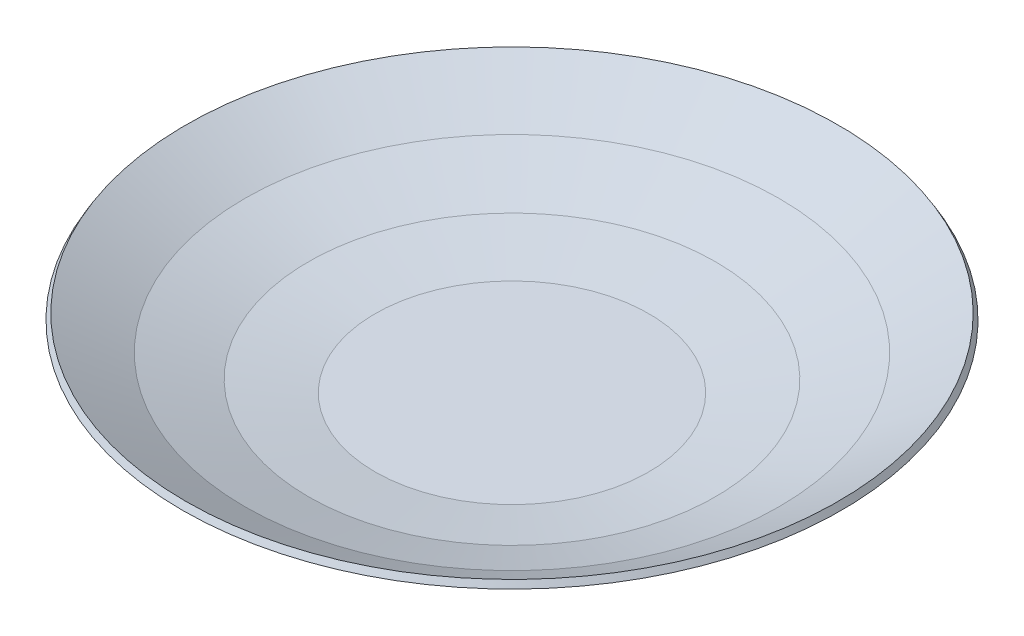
ISO-10303-21;
HEADER;
FILE_DESCRIPTION(('STEP AP214'),'2;1');
FILE_NAME('part.step','',(''),(''),'','','');
FILE_SCHEMA(('AUTOMOTIVE_DESIGN { 1 0 10303 214 1 1 1 1 }'));
ENDSEC;
DATA;
#1=APPLICATION_CONTEXT('core data for automotive mechanical design processes');
#2=APPLICATION_PROTOCOL_DEFINITION('international standard','automotive_design',2000,#1);
#3=PRODUCT_CONTEXT('',#1,'mechanical');
#4=PRODUCT('Part','Part','',(#3));
#5=PRODUCT_RELATED_PRODUCT_CATEGORY('part','',(#4));
#6=PRODUCT_DEFINITION_FORMATION('','',#4);
#7=PRODUCT_DEFINITION_CONTEXT('part definition',#1,'design');
#8=PRODUCT_DEFINITION('design','',#6,#7);
#9=PRODUCT_DEFINITION_SHAPE('','',#8);
#10=(LENGTH_UNIT() NAMED_UNIT(*) SI_UNIT(.MILLI.,.METRE.));
#11=(NAMED_UNIT(*) PLANE_ANGLE_UNIT() SI_UNIT($,.RADIAN.));
#12=(NAMED_UNIT(*) SI_UNIT($,.STERADIAN.) SOLID_ANGLE_UNIT());
#13=UNCERTAINTY_MEASURE_WITH_UNIT(LENGTH_MEASURE(1.E-05),#10,'distance_accuracy_value','');
#14=(GEOMETRIC_REPRESENTATION_CONTEXT(3) GLOBAL_UNCERTAINTY_ASSIGNED_CONTEXT((#13)) GLOBAL_UNIT_ASSIGNED_CONTEXT((#10,
#11,#12)) REPRESENTATION_CONTEXT('',''));
#15=CARTESIAN_POINT('',(0.,0.,0.));
#16=DIRECTION('',(0.,0.,1.));
#17=DIRECTION('',(1.,0.,0.));
#18=AXIS2_PLACEMENT_3D('',#15,#16,#17);
#19=CARTESIAN_POINT('',(24.4925601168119,0.,0.));
#20=DIRECTION('',(0.,1.,0.));
#21=DIRECTION('',(0.,0.,1.));
#22=AXIS2_PLACEMENT_3D('',#19,#20,#21);
#23=PLANE('',#22);
#24=CARTESIAN_POINT('',(0.,0.,0.));
#25=DIRECTION('',(0.,1.,0.));
#26=DIRECTION('',(0.,0.,1.));
#27=AXIS2_PLACEMENT_3D('',#24,#25,#26);
#28=CIRCLE('',#27,19.9125113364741);
#29=CARTESIAN_POINT('',(0.,0.,19.9125113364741));
#30=VERTEX_POINT('',#29);
#31=EDGE_CURVE('E10',#30,#30,#28,.T.);
#32=ORIENTED_EDGE('',*,*,#31,.F.);
#33=EDGE_LOOP('',(#32));
#34=FACE_BOUND('',#33,.T.);
#35=ADVANCED_FACE('F31',(#34),#23,.F.);
#36=CARTESIAN_POINT('',(0.,1.,0.));
#37=DIRECTION('',(0.,1.,0.));
#38=DIRECTION('',(0.,0.,1.));
#39=AXIS2_PLACEMENT_3D('',#36,#37,#38);
#40=TOROIDAL_SURFACE('',#39,19.9125113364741,1.);
#41=CARTESIAN_POINT('',(0.,0.0151922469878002,0.));
#42=DIRECTION('',(0.,1.,0.));
#43=DIRECTION('',(0.,0.,1.));
#44=AXIS2_PLACEMENT_3D('',#41,#42,#43);
#45=CIRCLE('',#44,20.086159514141);
#46=CARTESIAN_POINT('',(0.,0.0151922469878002,20.086159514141));
#47=VERTEX_POINT('',#46);
#48=EDGE_CURVE('E37',#47,#47,#45,.T.);
#49=ORIENTED_EDGE('',*,*,#48,.F.);
#50=EDGE_LOOP('',(#49));
#51=FACE_BOUND('',#50,.T.);
#52=ORIENTED_EDGE('',*,*,#31,.T.);
#53=EDGE_LOOP('',(#52));
#54=FACE_BOUND('',#53,.T.);
#55=ADVANCED_FACE('F88',(#51,#54),#40,.T.);
#56=CARTESIAN_POINT('',(0.,0.0151922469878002,0.));
#57=DIRECTION('',(0.,1.,0.));
#58=DIRECTION('',(0.,0.,1.));
#59=AXIS2_PLACEMENT_3D('',#56,#57,#58);
#60=CONICAL_SURFACE('',#59,20.086159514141,1.39626340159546);
#61=CARTESIAN_POINT('',(0.,1.72128952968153,0.));
#62=DIRECTION('',(0.,1.,0.));
#63=DIRECTION('',(0.,0.,1.));
#64=AXIS2_PLACEMENT_3D('',#61,#62,#63);
#65=CIRCLE('',#64,29.7619180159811);
#66=CARTESIAN_POINT('',(0.,1.72128952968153,29.7619180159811));
#67=VERTEX_POINT('',#66);
#68=EDGE_CURVE('E41',#67,#67,#65,.T.);
#69=ORIENTED_EDGE('',*,*,#68,.F.);
#70=EDGE_LOOP('',(#69));
#71=FACE_BOUND('',#70,.T.);
#72=ORIENTED_EDGE('',*,*,#48,.T.);
#73=EDGE_LOOP('',(#72));
#74=FACE_BOUND('',#73,.T.);
#75=ADVANCED_FACE('F93',(#71,#74),#60,.T.);
#76=CARTESIAN_POINT('',(0.,2.70609728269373,0.));
#77=DIRECTION('',(0.,1.,0.));
#78=DIRECTION('',(0.,0.,1.));
#79=AXIS2_PLACEMENT_3D('',#76,#77,#78);
#80=TOROIDAL_SURFACE('',#79,29.5882698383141,1.);
#81=CARTESIAN_POINT('',(0.,1.76640466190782,0.));
#82=DIRECTION('',(0.,1.,0.));
#83=DIRECTION('',(0.,0.,1.));
#84=AXIS2_PLACEMENT_3D('',#81,#82,#83);
#85=CIRCLE('',#84,29.9302899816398);
#86=CARTESIAN_POINT('',(0.,1.76640466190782,29.9302899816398));
#87=VERTEX_POINT('',#86);
#88=EDGE_CURVE('E45',#87,#87,#85,.T.);
#89=ORIENTED_EDGE('',*,*,#88,.F.);
#90=EDGE_LOOP('',(#89));
#91=FACE_BOUND('',#90,.T.);
#92=ORIENTED_EDGE('',*,*,#68,.T.);
#93=EDGE_LOOP('',(#92));
#94=FACE_BOUND('',#93,.T.);
#95=ADVANCED_FACE('F98',(#91,#94),#80,.T.);
#96=CARTESIAN_POINT('',(0.,1.76640466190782,0.));
#97=DIRECTION('',(0.,1.,0.));
#98=DIRECTION('',(0.,0.,1.));
#99=AXIS2_PLACEMENT_3D('',#96,#97,#98);
#100=CONICAL_SURFACE('',#99,29.9302899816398,1.22173047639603);
#101=CARTESIAN_POINT('',(0.,5.12676032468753,0.));
#102=DIRECTION('',(0.,1.,0.));
#103=DIRECTION('',(0.,0.,1.));
#104=AXIS2_PLACEMENT_3D('',#101,#102,#103);
#105=CIRCLE('',#104,39.1627912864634);
#106=CARTESIAN_POINT('',(0.,5.12676032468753,39.1627912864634));
#107=VERTEX_POINT('',#106);
#108=EDGE_CURVE('E50',#107,#107,#105,.T.);
#109=ORIENTED_EDGE('',*,*,#108,.F.);
#110=EDGE_LOOP('',(#109));
#111=FACE_BOUND('',#110,.T.);
#112=ORIENTED_EDGE('',*,*,#88,.T.);
#113=EDGE_LOOP('',(#112));
#114=FACE_BOUND('',#113,.T.);
#115=ADVANCED_FACE('F104',(#111,#114),#100,.T.);
#116=CARTESIAN_POINT('',(0.,6.06645294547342,0.));
#117=DIRECTION('',(0.,1.,0.));
#118=DIRECTION('',(0.,0.,1.));
#119=AXIS2_PLACEMENT_3D('',#116,#117,#118);
#120=TOROIDAL_SURFACE('',#119,38.8207711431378,0.999999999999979);
#121=CARTESIAN_POINT('',(0.,5.200427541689,0.));
#122=DIRECTION('',(0.,1.,0.));
#123=DIRECTION('',(0.,0.,1.));
#124=AXIS2_PLACEMENT_3D('',#121,#122,#123);
#125=CIRCLE('',#124,39.3207711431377);
#126=CARTESIAN_POINT('',(0.,5.200427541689,39.3207711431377));
#127=VERTEX_POINT('',#126);
#128=EDGE_CURVE('E53',#127,#127,#125,.T.);
#129=ORIENTED_EDGE('',*,*,#128,.F.);
#130=EDGE_LOOP('',(#129));
#131=FACE_BOUND('',#130,.T.);
#132=ORIENTED_EDGE('',*,*,#108,.T.);
#133=EDGE_LOOP('',(#132));
#134=FACE_BOUND('',#133,.T.);
#135=ADVANCED_FACE('F108',(#131,#134),#120,.T.);
#136=CARTESIAN_POINT('',(0.,5.200427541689,0.));
#137=DIRECTION('',(0.,1.,0.));
#138=DIRECTION('',(0.,0.,1.));
#139=AXIS2_PLACEMENT_3D('',#136,#137,#138);
#140=CONICAL_SURFACE('',#139,39.3207711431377,1.04719755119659);
#141=CARTESIAN_POINT('',(0.,10.1566832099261,0.));
#142=DIRECTION('',(0.,1.,0.));
#143=DIRECTION('',(0.,0.,1.));
#144=AXIS2_PLACEMENT_3D('',#141,#142,#143);
#145=CIRCLE('',#144,47.9052577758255);
#146=CARTESIAN_POINT('',(0.,10.1566832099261,47.9052577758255));
#147=VERTEX_POINT('',#146);
#148=EDGE_CURVE('E56',#147,#147,#145,.T.);
#149=ORIENTED_EDGE('',*,*,#148,.F.);
#150=EDGE_LOOP('',(#149));
#151=FACE_BOUND('',#150,.T.);
#152=ORIENTED_EDGE('',*,*,#128,.T.);
#153=EDGE_LOOP('',(#152));
#154=FACE_BOUND('',#153,.T.);
#155=ADVANCED_FACE('F112',(#151,#154),#140,.T.);
#156=CARTESIAN_POINT('',(0.,11.0227086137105,0.));
#157=DIRECTION('',(0.,-1.,0.));
#158=DIRECTION('',(0.,0.,-1.));
#159=AXIS2_PLACEMENT_3D('',#156,#157,#158);
#160=CONICAL_SURFACE('',#159,47.4052577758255,0.523598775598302);
#161=ORIENTED_EDGE('',*,*,#148,.T.);
#162=EDGE_LOOP('',(#161));
#163=FACE_BOUND('',#162,.T.);
#164=CARTESIAN_POINT('',(0.,11.0227086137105,0.));
#165=DIRECTION('',(0.,1.,0.));
#166=DIRECTION('',(0.,0.,1.));
#167=AXIS2_PLACEMENT_3D('',#164,#165,#166);
#168=CIRCLE('',#167,47.4052577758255);
#169=CARTESIAN_POINT('',(0.,11.0227086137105,47.4052577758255));
#170=VERTEX_POINT('',#169);
#171=EDGE_CURVE('E59',#170,#170,#168,.T.);
#172=ORIENTED_EDGE('',*,*,#171,.F.);
#173=EDGE_LOOP('',(#172));
#174=FACE_BOUND('',#173,.T.);
#175=ADVANCED_FACE('F116',(#163,#174),#160,.T.);
#176=CARTESIAN_POINT('',(0.,6.06645294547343,0.));
#177=DIRECTION('',(0.,1.,0.));
#178=DIRECTION('',(0.,0.,1.));
#179=AXIS2_PLACEMENT_3D('',#176,#177,#178);
#180=CONICAL_SURFACE('',#179,38.8207711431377,1.04719755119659);
#181=ORIENTED_EDGE('',*,*,#171,.T.);
#182=EDGE_LOOP('',(#181));
#183=FACE_BOUND('',#182,.T.);
#184=CARTESIAN_POINT('',(0.,6.06645294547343,0.));
#185=DIRECTION('',(0.,1.,0.));
#186=DIRECTION('',(0.,0.,1.));
#187=AXIS2_PLACEMENT_3D('',#184,#185,#186);
#188=CIRCLE('',#187,38.8207711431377);
#189=CARTESIAN_POINT('',(0.,6.06645294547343,38.8207711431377));
#190=VERTEX_POINT('',#189);
#191=EDGE_CURVE('E62',#190,#190,#188,.T.);
#192=ORIENTED_EDGE('',*,*,#191,.F.);
#193=EDGE_LOOP('',(#192));
#194=FACE_BOUND('',#193,.T.);
#195=ADVANCED_FACE('F84',(#183,#194),#180,.F.);
#196=CARTESIAN_POINT('',(0.,2.70609728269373,0.));
#197=DIRECTION('',(0.,1.,0.));
#198=DIRECTION('',(0.,0.,1.));
#199=AXIS2_PLACEMENT_3D('',#196,#197,#198);
#200=CONICAL_SURFACE('',#199,29.5882698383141,1.22173047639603);
#201=ORIENTED_EDGE('',*,*,#191,.T.);
#202=EDGE_LOOP('',(#201));
#203=FACE_BOUND('',#202,.T.);
#204=CARTESIAN_POINT('',(0.,2.70609728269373,0.));
#205=DIRECTION('',(0.,1.,0.));
#206=DIRECTION('',(0.,0.,1.));
#207=AXIS2_PLACEMENT_3D('',#204,#205,#206);
#208=CIRCLE('',#207,29.5882698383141);
#209=CARTESIAN_POINT('',(0.,2.70609728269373,29.5882698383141));
#210=VERTEX_POINT('',#209);
#211=EDGE_CURVE('E65',#210,#210,#208,.T.);
#212=ORIENTED_EDGE('',*,*,#211,.F.);
#213=EDGE_LOOP('',(#212));
#214=FACE_BOUND('',#213,.T.);
#215=ADVANCED_FACE('F76',(#203,#214),#200,.F.);
#216=CARTESIAN_POINT('',(0.,1.,0.));
#217=DIRECTION('',(0.,1.,0.));
#218=DIRECTION('',(0.,0.,1.));
#219=AXIS2_PLACEMENT_3D('',#216,#217,#218);
#220=CONICAL_SURFACE('',#219,19.9125113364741,1.39626340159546);
#221=ORIENTED_EDGE('',*,*,#211,.T.);
#222=EDGE_LOOP('',(#221));
#223=FACE_BOUND('',#222,.T.);
#224=CARTESIAN_POINT('',(0.,1.,0.));
#225=DIRECTION('',(0.,1.,0.));
#226=DIRECTION('',(0.,0.,1.));
#227=AXIS2_PLACEMENT_3D('',#224,#225,#226);
#228=CIRCLE('',#227,19.9125113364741);
#229=CARTESIAN_POINT('',(0.,1.,19.9125113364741));
#230=VERTEX_POINT('',#229);
#231=EDGE_CURVE('E68',#230,#230,#228,.T.);
#232=ORIENTED_EDGE('',*,*,#231,.F.);
#233=EDGE_LOOP('',(#232));
#234=FACE_BOUND('',#233,.T.);
#235=ADVANCED_FACE('F74',(#223,#234),#220,.F.);
#236=CARTESIAN_POINT('',(24.4925601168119,1.,0.));
#237=DIRECTION('',(0.,1.,0.));
#238=DIRECTION('',(0.,0.,1.));
#239=AXIS2_PLACEMENT_3D('',#236,#237,#238);
#240=PLANE('',#239);
#241=ORIENTED_EDGE('',*,*,#231,.T.);
#242=EDGE_LOOP('',(#241));
#243=FACE_BOUND('',#242,.T.);
#244=ADVANCED_FACE('F72',(#243),#240,.T.);
#245=CLOSED_SHELL('',(#35,#55,#75,#95,#115,#135,#155,#175,#195,#215,#235,#244));
#246=MANIFOLD_SOLID_BREP('B2',#245);
#247=ADVANCED_BREP_SHAPE_REPRESENTATION('',(#18,#246),#14);
#248=SHAPE_DEFINITION_REPRESENTATION(#9,#247);
ENDSEC;
END-ISO-10303-21;
